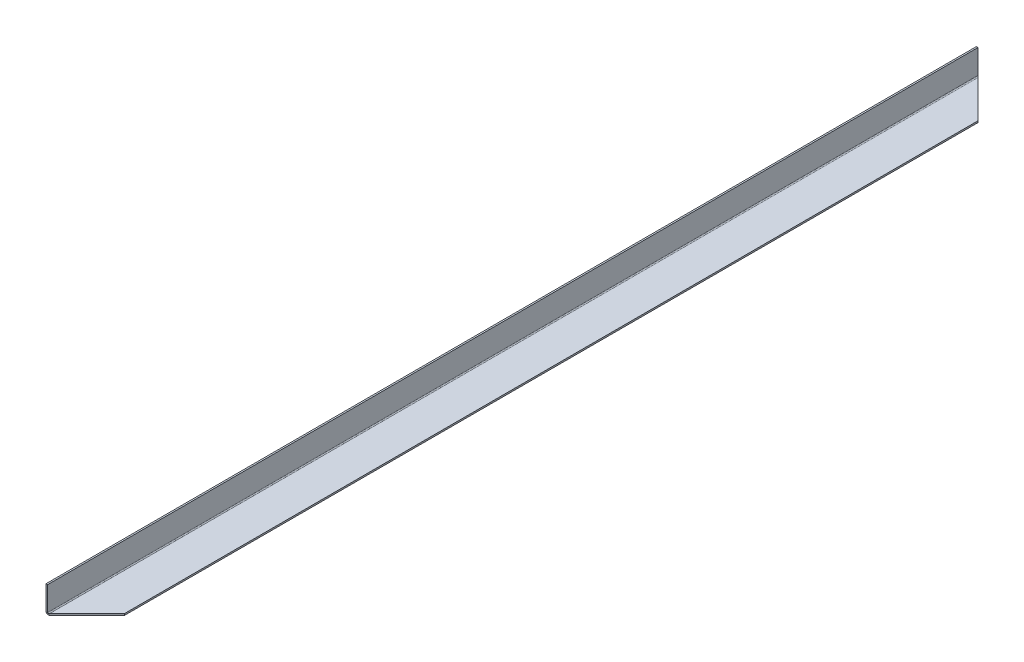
ISO-10303-21;
HEADER;
FILE_DESCRIPTION(('STEP AP214'),'2;1');
FILE_NAME('part.step','',(''),(''),'','','');
FILE_SCHEMA(('AUTOMOTIVE_DESIGN { 1 0 10303 214 1 1 1 1 }'));
ENDSEC;
DATA;
#1=APPLICATION_CONTEXT('core data for automotive mechanical design processes');
#2=APPLICATION_PROTOCOL_DEFINITION('international standard','automotive_design',2000,#1);
#3=PRODUCT_CONTEXT('',#1,'mechanical');
#4=PRODUCT('Part','Part','',(#3));
#5=PRODUCT_RELATED_PRODUCT_CATEGORY('part','',(#4));
#6=PRODUCT_DEFINITION_FORMATION('','',#4);
#7=PRODUCT_DEFINITION_CONTEXT('part definition',#1,'design');
#8=PRODUCT_DEFINITION('design','',#6,#7);
#9=PRODUCT_DEFINITION_SHAPE('','',#8);
#10=(LENGTH_UNIT() NAMED_UNIT(*) SI_UNIT(.MILLI.,.METRE.));
#11=(NAMED_UNIT(*) PLANE_ANGLE_UNIT() SI_UNIT($,.RADIAN.));
#12=(NAMED_UNIT(*) SI_UNIT($,.STERADIAN.) SOLID_ANGLE_UNIT());
#13=UNCERTAINTY_MEASURE_WITH_UNIT(LENGTH_MEASURE(1.E-05),#10,'distance_accuracy_value','');
#14=(GEOMETRIC_REPRESENTATION_CONTEXT(3) GLOBAL_UNCERTAINTY_ASSIGNED_CONTEXT((#13)) GLOBAL_UNIT_ASSIGNED_CONTEXT((#10,
#11,#12)) REPRESENTATION_CONTEXT('',''));
#15=CARTESIAN_POINT('',(0.,0.,0.));
#16=DIRECTION('',(0.,0.,1.));
#17=DIRECTION('',(1.,0.,0.));
#18=AXIS2_PLACEMENT_3D('',#15,#16,#17);
#19=CARTESIAN_POINT('',(0.,0.,700.));
#20=DIRECTION('',(0.,1.,0.));
#21=DIRECTION('',(0.,0.,1.));
#22=AXIS2_PLACEMENT_3D('',#19,#20,#21);
#23=PLANE('',#22);
#24=DIRECTION('',(0.707106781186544,0.,0.707106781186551));
#25=VECTOR('',#24,1.);
#26=CARTESIAN_POINT('',(350.,0.,350.000000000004));
#27=LINE('',#26,#25);
#28=CARTESIAN_POINT('',(1.9366,0.,1.93660000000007));
#29=VERTEX_POINT('',#28);
#30=CARTESIAN_POINT('',(30.,0.,30.0000000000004));
#31=VERTEX_POINT('',#30);
#32=EDGE_CURVE('E166',#29,#31,#27,.T.);
#33=ORIENTED_EDGE('',*,*,#32,.T.);
#34=DIRECTION('',(0.,0.,-1.));
#35=VECTOR('',#34,1.);
#36=CARTESIAN_POINT('',(30.,0.,700.));
#37=LINE('',#36,#35);
#38=CARTESIAN_POINT('',(30.,0.,669.999999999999));
#39=VERTEX_POINT('',#38);
#40=EDGE_CURVE('E11',#39,#31,#37,.T.);
#41=ORIENTED_EDGE('',*,*,#40,.F.);
#42=DIRECTION('',(-0.707106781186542,0.,0.707106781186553));
#43=VECTOR('',#42,1.);
#44=CARTESIAN_POINT('',(0.,0.,700.));
#45=LINE('',#44,#43);
#46=CARTESIAN_POINT('',(1.9366,0.,698.0634));
#47=VERTEX_POINT('',#46);
#48=EDGE_CURVE('E179',#39,#47,#45,.T.);
#49=ORIENTED_EDGE('',*,*,#48,.T.);
#50=DIRECTION('',(0.,0.,-1.));
#51=VECTOR('',#50,1.);
#52=CARTESIAN_POINT('',(1.9366,0.,700.));
#53=LINE('',#52,#51);
#54=EDGE_CURVE('E130',#47,#29,#53,.T.);
#55=ORIENTED_EDGE('',*,*,#54,.T.);
#56=EDGE_LOOP('',(#33,#41,#49,#55));
#57=FACE_BOUND('',#56,.T.);
#58=ADVANCED_FACE('F34',(#57),#23,.F.);
#59=CARTESIAN_POINT('',(30.,1.2,700.));
#60=DIRECTION('',(1.,0.,0.));
#61=DIRECTION('',(0.,0.,-1.));
#62=AXIS2_PLACEMENT_3D('',#59,#60,#61);
#63=PLANE('',#62);
#64=ORIENTED_EDGE('',*,*,#40,.T.);
#65=DIRECTION('',(0.,1.,0.));
#66=VECTOR('',#65,1.);
#67=CARTESIAN_POINT('',(30.,1.2,30.0000000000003));
#68=LINE('',#67,#66);
#69=CARTESIAN_POINT('',(30.,1.2,30.0000000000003));
#70=VERTEX_POINT('',#69);
#71=EDGE_CURVE('E160',#70,#31,#68,.F.);
#72=ORIENTED_EDGE('',*,*,#71,.F.);
#73=DIRECTION('',(0.,0.,-1.));
#74=VECTOR('',#73,1.);
#75=CARTESIAN_POINT('',(30.,1.2,700.));
#76=LINE('',#75,#74);
#77=CARTESIAN_POINT('',(30.,1.2,669.999999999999));
#78=VERTEX_POINT('',#77);
#79=EDGE_CURVE('E41',#78,#70,#76,.T.);
#80=ORIENTED_EDGE('',*,*,#79,.F.);
#81=DIRECTION('',(0.,1.,0.));
#82=VECTOR('',#81,1.);
#83=CARTESIAN_POINT('',(30.,1.2,669.999999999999));
#84=LINE('',#83,#82);
#85=EDGE_CURVE('E158',#78,#39,#84,.F.);
#86=ORIENTED_EDGE('',*,*,#85,.T.);
#87=EDGE_LOOP('',(#64,#72,#80,#86));
#88=FACE_BOUND('',#87,.T.);
#89=ADVANCED_FACE('F157',(#88),#63,.T.);
#90=CARTESIAN_POINT('',(0.,1.2,700.));
#91=DIRECTION('',(0.,1.,0.));
#92=DIRECTION('',(0.,0.,1.));
#93=AXIS2_PLACEMENT_3D('',#90,#91,#92);
#94=PLANE('',#93);
#95=ORIENTED_EDGE('',*,*,#79,.T.);
#96=DIRECTION('',(0.707106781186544,0.,0.707106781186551));
#97=VECTOR('',#96,1.);
#98=CARTESIAN_POINT('',(350.,1.2,350.000000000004));
#99=LINE('',#98,#97);
#100=CARTESIAN_POINT('',(1.9366,1.2,1.93660000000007));
#101=VERTEX_POINT('',#100);
#102=EDGE_CURVE('E115',#101,#70,#99,.T.);
#103=ORIENTED_EDGE('',*,*,#102,.F.);
#104=DIRECTION('',(0.,0.,-1.));
#105=VECTOR('',#104,1.);
#106=CARTESIAN_POINT('',(1.9366,1.2,700.));
#107=LINE('',#106,#105);
#108=CARTESIAN_POINT('',(1.9366,1.2,698.0634));
#109=VERTEX_POINT('',#108);
#110=EDGE_CURVE('E143',#109,#101,#107,.T.);
#111=ORIENTED_EDGE('',*,*,#110,.F.);
#112=DIRECTION('',(-0.707106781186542,0.,0.707106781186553));
#113=VECTOR('',#112,1.);
#114=CARTESIAN_POINT('',(0.,1.2,700.));
#115=LINE('',#114,#113);
#116=EDGE_CURVE('E153',#78,#109,#115,.T.);
#117=ORIENTED_EDGE('',*,*,#116,.F.);
#118=EDGE_LOOP('',(#95,#103,#111,#117));
#119=FACE_BOUND('',#118,.T.);
#120=ADVANCED_FACE('F150',(#119),#94,.T.);
#121=CARTESIAN_POINT('',(1.9366,1.9366,700.));
#122=DIRECTION('',(0.,0.,-1.));
#123=DIRECTION('',(-1.,0.,0.));
#124=AXIS2_PLACEMENT_3D('',#121,#122,#123);
#125=CYLINDRICAL_SURFACE('',#124,0.7366);
#126=ORIENTED_EDGE('',*,*,#110,.T.);
#127=CARTESIAN_POINT('',(1.9366,1.9366,1.93660000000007));
#128=DIRECTION('',(-0.707106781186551,0.,0.707106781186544));
#129=DIRECTION('',(-0.707106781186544,0.,-0.707106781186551));
#130=AXIS2_PLACEMENT_3D('',#127,#128,#129);
#131=ELLIPSE('',#130,1.04170971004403,0.7366);
#132=CARTESIAN_POINT('',(1.2,1.9366,1.20000000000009));
#133=VERTEX_POINT('',#132);
#134=EDGE_CURVE('E107',#133,#101,#131,.T.);
#135=ORIENTED_EDGE('',*,*,#134,.F.);
#136=DIRECTION('',(0.,0.,-1.));
#137=VECTOR('',#136,1.);
#138=CARTESIAN_POINT('',(1.2,1.9366,700.));
#139=LINE('',#138,#137);
#140=CARTESIAN_POINT('',(1.2,1.9366,698.8));
#141=VERTEX_POINT('',#140);
#142=EDGE_CURVE('E140',#141,#133,#139,.T.);
#143=ORIENTED_EDGE('',*,*,#142,.F.);
#144=CARTESIAN_POINT('',(1.9366,1.9366,698.0634));
#145=DIRECTION('',(-0.707106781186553,0.,-0.707106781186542));
#146=DIRECTION('',(0.707106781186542,0.,-0.707106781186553));
#147=AXIS2_PLACEMENT_3D('',#144,#145,#146);
#148=ELLIPSE('',#147,1.04170971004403,0.7366);
#149=EDGE_CURVE('E163',#109,#141,#148,.T.);
#150=ORIENTED_EDGE('',*,*,#149,.F.);
#151=EDGE_LOOP('',(#126,#135,#143,#150));
#152=FACE_BOUND('',#151,.T.);
#153=ADVANCED_FACE('F211',(#152),#125,.F.);
#154=CARTESIAN_POINT('',(1.2,20.,700.));
#155=DIRECTION('',(1.,0.,0.));
#156=DIRECTION('',(0.,1.,0.));
#157=AXIS2_PLACEMENT_3D('',#154,#155,#156);
#158=PLANE('',#157);
#159=ORIENTED_EDGE('',*,*,#142,.T.);
#160=DIRECTION('',(0.,-1.,0.));
#161=VECTOR('',#160,1.);
#162=CARTESIAN_POINT('',(1.2,20.,1.20000000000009));
#163=LINE('',#162,#161);
#164=CARTESIAN_POINT('',(1.20000000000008,20.,1.20000000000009));
#165=VERTEX_POINT('',#164);
#166=EDGE_CURVE('E106',#165,#133,#163,.T.);
#167=ORIENTED_EDGE('',*,*,#166,.F.);
#168=DIRECTION('',(0.,0.,-1.));
#169=VECTOR('',#168,1.);
#170=CARTESIAN_POINT('',(1.2,20.,700.));
#171=LINE('',#170,#169);
#172=CARTESIAN_POINT('',(1.19999999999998,20.,698.8));
#173=VERTEX_POINT('',#172);
#174=EDGE_CURVE('E132',#173,#165,#171,.T.);
#175=ORIENTED_EDGE('',*,*,#174,.F.);
#176=DIRECTION('',(0.,1.,0.));
#177=VECTOR('',#176,1.);
#178=CARTESIAN_POINT('',(1.2,20.,698.8));
#179=LINE('',#178,#177);
#180=EDGE_CURVE('E171',#141,#173,#179,.T.);
#181=ORIENTED_EDGE('',*,*,#180,.F.);
#182=EDGE_LOOP('',(#159,#167,#175,#181));
#183=FACE_BOUND('',#182,.T.);
#184=ADVANCED_FACE('F216',(#183),#158,.T.);
#185=CARTESIAN_POINT('',(0.,20.,700.));
#186=DIRECTION('',(0.,1.,0.));
#187=DIRECTION('',(0.,0.,1.));
#188=AXIS2_PLACEMENT_3D('',#185,#186,#187);
#189=PLANE('',#188);
#190=ORIENTED_EDGE('',*,*,#174,.T.);
#191=DIRECTION('',(1.,0.,0.));
#192=VECTOR('',#191,1.);
#193=CARTESIAN_POINT('',(1.20000000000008,20.,1.20000000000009));
#194=LINE('',#193,#192);
#195=CARTESIAN_POINT('',(0.,20.,1.20000000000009));
#196=VERTEX_POINT('',#195);
#197=EDGE_CURVE('E116',#165,#196,#194,.F.);
#198=ORIENTED_EDGE('',*,*,#197,.T.);
#199=DIRECTION('',(0.,0.,-1.));
#200=VECTOR('',#199,1.);
#201=CARTESIAN_POINT('',(0.,20.,700.));
#202=LINE('',#201,#200);
#203=CARTESIAN_POINT('',(0.,20.,698.8));
#204=VERTEX_POINT('',#203);
#205=EDGE_CURVE('E125',#204,#196,#202,.T.);
#206=ORIENTED_EDGE('',*,*,#205,.F.);
#207=DIRECTION('',(1.,0.,0.));
#208=VECTOR('',#207,1.);
#209=CARTESIAN_POINT('',(1.19999999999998,20.,698.8));
#210=LINE('',#209,#208);
#211=EDGE_CURVE('E176',#173,#204,#210,.F.);
#212=ORIENTED_EDGE('',*,*,#211,.F.);
#213=EDGE_LOOP('',(#190,#198,#206,#212));
#214=FACE_BOUND('',#213,.T.);
#215=ADVANCED_FACE('F219',(#214),#189,.T.);
#216=CARTESIAN_POINT('',(0.,20.,700.));
#217=DIRECTION('',(1.,0.,0.));
#218=DIRECTION('',(0.,1.,0.));
#219=AXIS2_PLACEMENT_3D('',#216,#217,#218);
#220=PLANE('',#219);
#221=DIRECTION('',(0.,1.,0.));
#222=VECTOR('',#221,1.);
#223=CARTESIAN_POINT('',(0.,20.,1.20000000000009));
#224=LINE('',#223,#222);
#225=CARTESIAN_POINT('',(0.,1.9366,1.20000000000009));
#226=VERTEX_POINT('',#225);
#227=EDGE_CURVE('E112',#196,#226,#224,.F.);
#228=ORIENTED_EDGE('',*,*,#227,.T.);
#229=DIRECTION('',(0.,0.,-1.));
#230=VECTOR('',#229,1.);
#231=CARTESIAN_POINT('',(0.,1.9366,700.));
#232=LINE('',#231,#230);
#233=CARTESIAN_POINT('',(0.,1.9366,698.8));
#234=VERTEX_POINT('',#233);
#235=EDGE_CURVE('E123',#234,#226,#232,.T.);
#236=ORIENTED_EDGE('',*,*,#235,.F.);
#237=DIRECTION('',(0.,1.,0.));
#238=VECTOR('',#237,1.);
#239=CARTESIAN_POINT('',(0.,20.,698.8));
#240=LINE('',#239,#238);
#241=EDGE_CURVE('E173',#234,#204,#240,.T.);
#242=ORIENTED_EDGE('',*,*,#241,.T.);
#243=ORIENTED_EDGE('',*,*,#205,.T.);
#244=EDGE_LOOP('',(#228,#236,#242,#243));
#245=FACE_BOUND('',#244,.T.);
#246=ADVANCED_FACE('F121',(#245),#220,.F.);
#247=CARTESIAN_POINT('',(1.9366,1.9366,700.));
#248=DIRECTION('',(0.,0.,-1.));
#249=DIRECTION('',(-1.,0.,0.));
#250=AXIS2_PLACEMENT_3D('',#247,#248,#249);
#251=CYLINDRICAL_SURFACE('',#250,1.9366);
#252=CARTESIAN_POINT('',(1.9366,1.9366,1.93660000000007));
#253=DIRECTION('',(-0.355509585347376,0.,0.934672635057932));
#254=DIRECTION('',(-0.934672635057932,0.,-0.355509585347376));
#255=AXIS2_PLACEMENT_3D('',#252,#253,#254);
#256=ELLIPSE('',#255,2.07195538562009,1.9366);
#257=EDGE_CURVE('E97',#226,#29,#256,.T.);
#258=ORIENTED_EDGE('',*,*,#257,.T.);
#259=ORIENTED_EDGE('',*,*,#54,.F.);
#260=CARTESIAN_POINT('',(1.9366,1.9366,698.0634));
#261=DIRECTION('',(-0.355509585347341,0.,-0.934672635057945));
#262=DIRECTION('',(0.934672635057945,0.,-0.355509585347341));
#263=AXIS2_PLACEMENT_3D('',#260,#261,#262);
#264=ELLIPSE('',#263,2.07195538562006,1.9366);
#265=EDGE_CURVE('E129',#47,#234,#264,.T.);
#266=ORIENTED_EDGE('',*,*,#265,.T.);
#267=ORIENTED_EDGE('',*,*,#235,.T.);
#268=EDGE_LOOP('',(#258,#259,#266,#267));
#269=FACE_BOUND('',#268,.T.);
#270=ADVANCED_FACE('F128',(#269),#251,.T.);
#271=CARTESIAN_POINT('',(0.,1.2,700.));
#272=DIRECTION('',(-0.707106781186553,0.,-0.707106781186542));
#273=DIRECTION('',(-0.707106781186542,0.,0.707106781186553));
#274=AXIS2_PLACEMENT_3D('',#271,#272,#273);
#275=PLANE('',#274);
#276=ORIENTED_EDGE('',*,*,#116,.T.);
#277=DIRECTION('',(0.,1.,0.));
#278=VECTOR('',#277,1.);
#279=CARTESIAN_POINT('',(1.9366,1.2,698.0634));
#280=LINE('',#279,#278);
#281=EDGE_CURVE('E134',#109,#47,#280,.F.);
#282=ORIENTED_EDGE('',*,*,#281,.T.);
#283=ORIENTED_EDGE('',*,*,#48,.F.);
#284=ORIENTED_EDGE('',*,*,#85,.F.);
#285=EDGE_LOOP('',(#276,#282,#283,#284));
#286=FACE_BOUND('',#285,.T.);
#287=ADVANCED_FACE('F185',(#286),#275,.F.);
#288=CARTESIAN_POINT('',(1.2,20.,698.8));
#289=DIRECTION('',(0.,0.,-1.));
#290=DIRECTION('',(0.,1.,0.));
#291=AXIS2_PLACEMENT_3D('',#288,#289,#290);
#292=PLANE('',#291);
#293=ORIENTED_EDGE('',*,*,#180,.T.);
#294=ORIENTED_EDGE('',*,*,#211,.T.);
#295=ORIENTED_EDGE('',*,*,#241,.F.);
#296=DIRECTION('',(1.,0.,0.));
#297=VECTOR('',#296,1.);
#298=CARTESIAN_POINT('',(1.2,1.9366,698.8));
#299=LINE('',#298,#297);
#300=EDGE_CURVE('E56',#141,#234,#299,.F.);
#301=ORIENTED_EDGE('',*,*,#300,.F.);
#302=EDGE_LOOP('',(#293,#294,#295,#301));
#303=FACE_BOUND('',#302,.T.);
#304=ADVANCED_FACE('F202',(#303),#292,.F.);
#305=CARTESIAN_POINT('',(2.6732,1.9366,697.3268));
#306=CARTESIAN_POINT('',(3.0732,1.9366,697.3268));
#307=CARTESIAN_POINT('',(3.4732,1.9366,697.3268));
#308=CARTESIAN_POINT('',(3.8732,1.9366,697.3268));
#309=CARTESIAN_POINT('',(2.6732,0.463400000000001,697.3268));
#310=CARTESIAN_POINT('',(3.0732,-0.336599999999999,697.3268));
#311=CARTESIAN_POINT('',(3.4732,-1.1366,697.3268));
#312=CARTESIAN_POINT('',(3.8732,-1.9366,697.3268));
#313=CARTESIAN_POINT('',(1.2,0.463400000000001,698.8));
#314=CARTESIAN_POINT('',(0.800000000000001,-0.336599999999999,698.8));
#315=CARTESIAN_POINT('',(0.400000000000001,-1.1366,698.8));
#316=CARTESIAN_POINT('',(0.,-1.9366,698.8));
#317=CARTESIAN_POINT('',(1.2,1.9366,698.8));
#318=CARTESIAN_POINT('',(0.8,1.9366,698.8));
#319=CARTESIAN_POINT('',(0.4,1.9366,698.8));
#320=CARTESIAN_POINT('',(0.,1.9366,698.8));
#321=CARTESIAN_POINT('',(1.2,3.4098,698.8));
#322=CARTESIAN_POINT('',(0.8,4.2098,698.8));
#323=CARTESIAN_POINT('',(0.4,5.0098,698.8));
#324=CARTESIAN_POINT('',(0.,5.8098,698.8));
#325=CARTESIAN_POINT('',(2.6732,3.4098,697.3268));
#326=CARTESIAN_POINT('',(3.0732,4.2098,697.3268));
#327=CARTESIAN_POINT('',(3.4732,5.0098,697.3268));
#328=CARTESIAN_POINT('',(3.8732,5.8098,697.3268));
#329=CARTESIAN_POINT('',(2.6732,1.9366,697.3268));
#330=CARTESIAN_POINT('',(3.0732,1.9366,697.3268));
#331=CARTESIAN_POINT('',(3.4732,1.9366,697.3268));
#332=CARTESIAN_POINT('',(3.8732,1.9366,697.3268));
#333=(BOUNDED_SURFACE() B_SPLINE_SURFACE(3,3,((#305,#306,#307,#308),(#309,#310,#311,#312),(#313,
#314,#315,#316),(#317,#318,#319,#320),(#321,#322,#323,#324),(#325,#326,#327,#328),(#329,#330,
#331,#332)),.UNSPECIFIED.,.T.,.F.,.F.) B_SPLINE_SURFACE_WITH_KNOTS((4,3,4),(4,4),(0.,0.5,1.),
(0.,1.),.UNSPECIFIED.) GEOMETRIC_REPRESENTATION_ITEM() RATIONAL_B_SPLINE_SURFACE(((1.,1.,1.,1.),
(0.333333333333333,0.333333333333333,0.333333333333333,0.333333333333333),(0.333333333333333,
0.333333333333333,0.333333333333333,0.333333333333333),(1.,1.,1.,1.),(0.333333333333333,
0.333333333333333,0.333333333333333,0.333333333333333),(0.333333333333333,0.333333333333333,
0.333333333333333,0.333333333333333),(1.,1.,1.,1.))) REPRESENTATION_ITEM('') SURFACE());
#334=ORIENTED_EDGE('',*,*,#149,.T.);
#335=ORIENTED_EDGE('',*,*,#300,.T.);
#336=ORIENTED_EDGE('',*,*,#265,.F.);
#337=ORIENTED_EDGE('',*,*,#281,.F.);
#338=EDGE_LOOP('',(#334,#335,#336,#337));
#339=FACE_BOUND('',#338,.T.);
#340=ADVANCED_FACE('F195',(#339),#333,.T.);
#341=CARTESIAN_POINT('',(350.,1.2,350.000000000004));
#342=DIRECTION('',(-0.707106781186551,0.,0.707106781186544));
#343=DIRECTION('',(0.707106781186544,0.,0.707106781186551));
#344=AXIS2_PLACEMENT_3D('',#341,#342,#343);
#345=PLANE('',#344);
#346=ORIENTED_EDGE('',*,*,#102,.T.);
#347=ORIENTED_EDGE('',*,*,#71,.T.);
#348=ORIENTED_EDGE('',*,*,#32,.F.);
#349=DIRECTION('',(0.,1.,0.));
#350=VECTOR('',#349,1.);
#351=CARTESIAN_POINT('',(1.9366,1.2,1.93660000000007));
#352=LINE('',#351,#350);
#353=EDGE_CURVE('E48',#101,#29,#352,.F.);
#354=ORIENTED_EDGE('',*,*,#353,.F.);
#355=EDGE_LOOP('',(#346,#347,#348,#354));
#356=FACE_BOUND('',#355,.T.);
#357=ADVANCED_FACE('F193',(#356),#345,.F.);
#358=CARTESIAN_POINT('',(1.2,20.,1.20000000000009));
#359=DIRECTION('',(0.,0.,1.));
#360=DIRECTION('',(0.,-1.,0.));
#361=AXIS2_PLACEMENT_3D('',#358,#359,#360);
#362=PLANE('',#361);
#363=ORIENTED_EDGE('',*,*,#166,.T.);
#364=DIRECTION('',(1.,0.,0.));
#365=VECTOR('',#364,1.);
#366=CARTESIAN_POINT('',(1.2,1.9366,1.20000000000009));
#367=LINE('',#366,#365);
#368=EDGE_CURVE('E100',#133,#226,#367,.F.);
#369=ORIENTED_EDGE('',*,*,#368,.T.);
#370=ORIENTED_EDGE('',*,*,#227,.F.);
#371=ORIENTED_EDGE('',*,*,#197,.F.);
#372=EDGE_LOOP('',(#363,#369,#370,#371));
#373=FACE_BOUND('',#372,.T.);
#374=ADVANCED_FACE('F111',(#373),#362,.F.);
#375=CARTESIAN_POINT('',(1.2,1.9366,1.20000000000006));
#376=CARTESIAN_POINT('',(0.8,1.9366,1.20000000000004));
#377=CARTESIAN_POINT('',(0.4,1.9366,1.20000000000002));
#378=CARTESIAN_POINT('',(0.,1.9366,1.20000000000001));
#379=CARTESIAN_POINT('',(1.2,0.463400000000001,1.20000000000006));
#380=CARTESIAN_POINT('',(0.8,-0.3366,1.20000000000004));
#381=CARTESIAN_POINT('',(0.4,-1.1366,1.20000000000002));
#382=CARTESIAN_POINT('',(0.,-1.9366,1.20000000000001));
#383=CARTESIAN_POINT('',(2.6732,0.463400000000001,2.67320000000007));
#384=CARTESIAN_POINT('',(3.0732,-0.3366,2.67320000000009));
#385=CARTESIAN_POINT('',(3.4732,-1.1366,2.67320000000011));
#386=CARTESIAN_POINT('',(3.8732,-1.9366,2.67320000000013));
#387=CARTESIAN_POINT('',(2.6732,1.9366,2.67320000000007));
#388=CARTESIAN_POINT('',(3.0732,1.9366,2.67320000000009));
#389=CARTESIAN_POINT('',(3.4732,1.9366,2.67320000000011));
#390=CARTESIAN_POINT('',(3.8732,1.9366,2.67320000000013));
#391=CARTESIAN_POINT('',(2.6732,3.4098,2.67320000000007));
#392=CARTESIAN_POINT('',(3.0732,4.2098,2.67320000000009));
#393=CARTESIAN_POINT('',(3.4732,5.0098,2.67320000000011));
#394=CARTESIAN_POINT('',(3.8732,5.8098,2.67320000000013));
#395=CARTESIAN_POINT('',(1.2,3.4098,1.20000000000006));
#396=CARTESIAN_POINT('',(0.8,4.2098,1.20000000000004));
#397=CARTESIAN_POINT('',(0.4,5.0098,1.20000000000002));
#398=CARTESIAN_POINT('',(0.,5.8098,1.20000000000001));
#399=CARTESIAN_POINT('',(1.2,1.9366,1.20000000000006));
#400=CARTESIAN_POINT('',(0.8,1.9366,1.20000000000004));
#401=CARTESIAN_POINT('',(0.4,1.9366,1.20000000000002));
#402=CARTESIAN_POINT('',(0.,1.9366,1.20000000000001));
#403=(BOUNDED_SURFACE() B_SPLINE_SURFACE(3,3,((#375,#376,#377,#378),(#379,#380,#381,#382),(#383,
#384,#385,#386),(#387,#388,#389,#390),(#391,#392,#393,#394),(#395,#396,#397,#398),(#399,#400,
#401,#402)),.UNSPECIFIED.,.T.,.F.,.F.) B_SPLINE_SURFACE_WITH_KNOTS((4,3,4),(4,4),(0.,0.5,1.),
(0.,1.),.UNSPECIFIED.) GEOMETRIC_REPRESENTATION_ITEM() RATIONAL_B_SPLINE_SURFACE(((1.,1.,1.,1.),
(0.333333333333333,0.333333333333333,0.333333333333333,0.333333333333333),(0.333333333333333,
0.333333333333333,0.333333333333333,0.333333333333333),(1.,1.,1.,1.),(0.333333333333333,
0.333333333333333,0.333333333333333,0.333333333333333),(0.333333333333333,0.333333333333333,
0.333333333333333,0.333333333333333),(1.,1.,1.,1.))) REPRESENTATION_ITEM('') SURFACE());
#404=ORIENTED_EDGE('',*,*,#134,.T.);
#405=ORIENTED_EDGE('',*,*,#353,.T.);
#406=ORIENTED_EDGE('',*,*,#257,.F.);
#407=ORIENTED_EDGE('',*,*,#368,.F.);
#408=EDGE_LOOP('',(#404,#405,#406,#407));
#409=FACE_BOUND('',#408,.T.);
#410=ADVANCED_FACE('F99',(#409),#403,.T.);
#411=CLOSED_SHELL('',(#58,#89,#120,#153,#184,#215,#246,#270,#287,#304,#340,#357,#374,#410));
#412=MANIFOLD_SOLID_BREP('B2',#411);
#413=ADVANCED_BREP_SHAPE_REPRESENTATION('',(#18,#412),#14);
#414=SHAPE_DEFINITION_REPRESENTATION(#9,#413);
ENDSEC;
END-ISO-10303-21;
